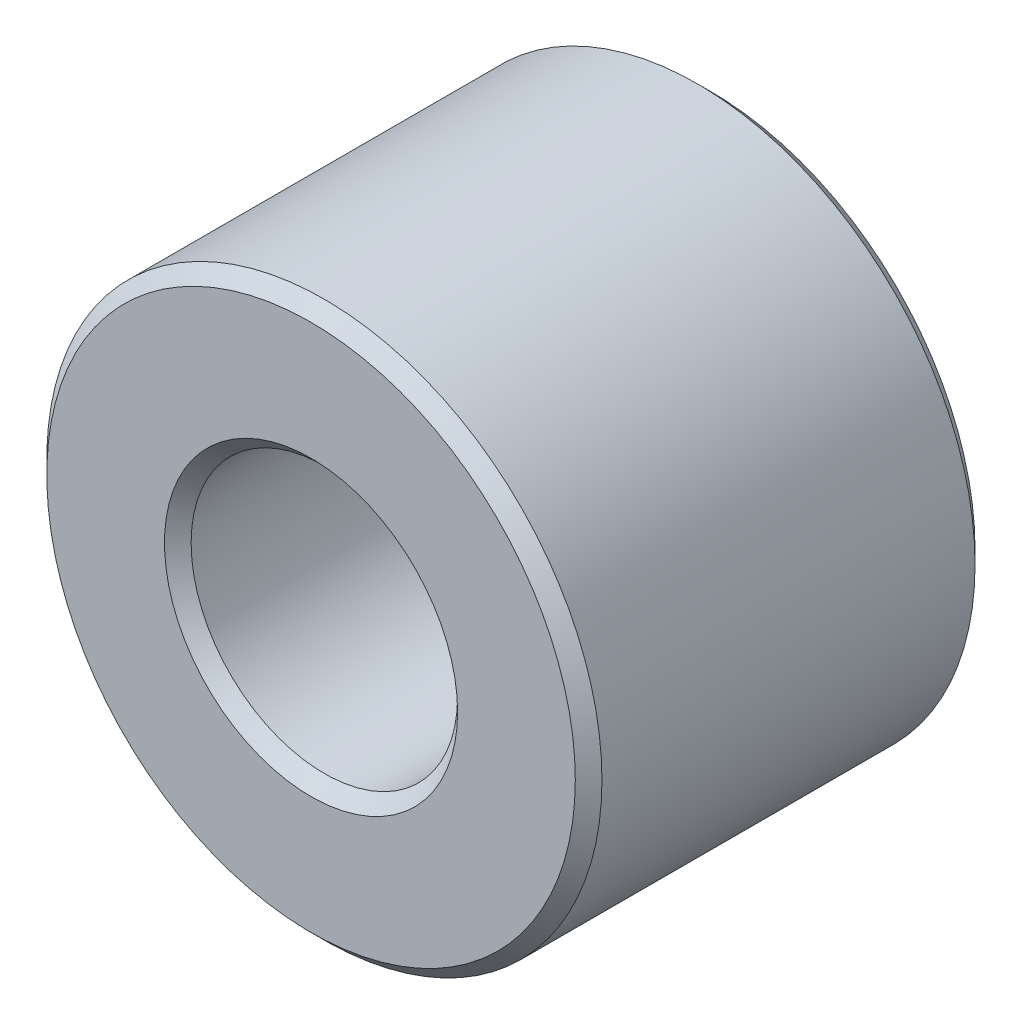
ISO-10303-21;
HEADER;
FILE_DESCRIPTION(('STEP AP214'),'2;1');
FILE_NAME('part.step','',(''),(''),'','','');
FILE_SCHEMA(('AUTOMOTIVE_DESIGN { 1 0 10303 214 1 1 1 1 }'));
ENDSEC;
DATA;
#1=APPLICATION_CONTEXT('core data for automotive mechanical design processes');
#2=APPLICATION_PROTOCOL_DEFINITION('international standard','automotive_design',2000,#1);
#3=PRODUCT_CONTEXT('',#1,'mechanical');
#4=PRODUCT('Part','Part','',(#3));
#5=PRODUCT_RELATED_PRODUCT_CATEGORY('part','',(#4));
#6=PRODUCT_DEFINITION_FORMATION('','',#4);
#7=PRODUCT_DEFINITION_CONTEXT('part definition',#1,'design');
#8=PRODUCT_DEFINITION('design','',#6,#7);
#9=PRODUCT_DEFINITION_SHAPE('','',#8);
#10=(LENGTH_UNIT() NAMED_UNIT(*) SI_UNIT(.MILLI.,.METRE.));
#11=(NAMED_UNIT(*) PLANE_ANGLE_UNIT() SI_UNIT($,.RADIAN.));
#12=(NAMED_UNIT(*) SI_UNIT($,.STERADIAN.) SOLID_ANGLE_UNIT());
#13=UNCERTAINTY_MEASURE_WITH_UNIT(LENGTH_MEASURE(1.E-05),#10,'distance_accuracy_value','');
#14=(GEOMETRIC_REPRESENTATION_CONTEXT(3) GLOBAL_UNCERTAINTY_ASSIGNED_CONTEXT((#13)) GLOBAL_UNIT_ASSIGNED_CONTEXT((#10,
#11,#12)) REPRESENTATION_CONTEXT('',''));
#15=CARTESIAN_POINT('',(0.,0.,0.));
#16=DIRECTION('',(0.,0.,1.));
#17=DIRECTION('',(1.,0.,0.));
#18=AXIS2_PLACEMENT_3D('',#15,#16,#17);
#19=CARTESIAN_POINT('',(0.,0.,18.));
#20=DIRECTION('',(0.,0.,1.));
#21=DIRECTION('',(1.,0.,0.));
#22=AXIS2_PLACEMENT_3D('',#19,#20,#21);
#23=PLANE('',#22);
#24=CARTESIAN_POINT('',(0.,0.,18.));
#25=DIRECTION('',(0.,0.,1.));
#26=DIRECTION('',(1.,0.,0.));
#27=AXIS2_PLACEMENT_3D('',#24,#25,#26);
#28=CIRCLE('',#27,13.2);
#29=CARTESIAN_POINT('',(13.2,0.,18.));
#30=VERTEX_POINT('',#29);
#31=EDGE_CURVE('E10',#30,#30,#28,.F.);
#32=ORIENTED_EDGE('',*,*,#31,.T.);
#33=EDGE_LOOP('',(#32));
#34=FACE_BOUND('',#33,.T.);
#35=CARTESIAN_POINT('',(0.,0.,18.));
#36=DIRECTION('',(0.,0.,1.));
#37=DIRECTION('',(1.,0.,0.));
#38=AXIS2_PLACEMENT_3D('',#35,#36,#37);
#39=CIRCLE('',#38,23.8);
#40=CARTESIAN_POINT('',(23.8,0.,18.));
#41=VERTEX_POINT('',#40);
#42=EDGE_CURVE('E45',#41,#41,#39,.T.);
#43=ORIENTED_EDGE('',*,*,#42,.T.);
#44=EDGE_LOOP('',(#43));
#45=FACE_BOUND('',#44,.T.);
#46=ADVANCED_FACE('F37',(#34,#45),#23,.T.);
#47=CARTESIAN_POINT('',(0.,0.,-18.));
#48=DIRECTION('',(0.,0.,1.));
#49=DIRECTION('',(1.,0.,0.));
#50=AXIS2_PLACEMENT_3D('',#47,#48,#49);
#51=PLANE('',#50);
#52=CARTESIAN_POINT('',(0.,0.,-18.));
#53=DIRECTION('',(0.,0.,1.));
#54=DIRECTION('',(1.,0.,0.));
#55=AXIS2_PLACEMENT_3D('',#52,#53,#54);
#56=CIRCLE('',#55,13.2);
#57=CARTESIAN_POINT('',(13.2,0.,-18.));
#58=VERTEX_POINT('',#57);
#59=EDGE_CURVE('E70',#58,#58,#56,.T.);
#60=ORIENTED_EDGE('',*,*,#59,.T.);
#61=EDGE_LOOP('',(#60));
#62=FACE_BOUND('',#61,.T.);
#63=CARTESIAN_POINT('',(0.,0.,-18.));
#64=DIRECTION('',(0.,0.,1.));
#65=DIRECTION('',(1.,0.,0.));
#66=AXIS2_PLACEMENT_3D('',#63,#64,#65);
#67=CIRCLE('',#66,23.8);
#68=CARTESIAN_POINT('',(23.8,0.,-18.));
#69=VERTEX_POINT('',#68);
#70=EDGE_CURVE('E74',#69,#69,#67,.F.);
#71=ORIENTED_EDGE('',*,*,#70,.T.);
#72=EDGE_LOOP('',(#71));
#73=FACE_BOUND('',#72,.T.);
#74=ADVANCED_FACE('F78',(#62,#73),#51,.F.);
#75=CARTESIAN_POINT('',(0.,0.,18.));
#76=DIRECTION('',(0.,0.,-1.));
#77=DIRECTION('',(-1.,0.,0.));
#78=AXIS2_PLACEMENT_3D('',#75,#76,#77);
#79=CYLINDRICAL_SURFACE('',#78,25.);
#80=CARTESIAN_POINT('',(0.,0.,-16.8));
#81=DIRECTION('',(0.,0.,1.));
#82=DIRECTION('',(1.,0.,0.));
#83=AXIS2_PLACEMENT_3D('',#80,#81,#82);
#84=CIRCLE('',#83,25.);
#85=CARTESIAN_POINT('',(25.,0.,-16.8));
#86=VERTEX_POINT('',#85);
#87=EDGE_CURVE('E52',#86,#86,#84,.T.);
#88=ORIENTED_EDGE('',*,*,#87,.T.);
#89=EDGE_LOOP('',(#88));
#90=FACE_BOUND('',#89,.T.);
#91=CARTESIAN_POINT('',(0.,0.,16.8));
#92=DIRECTION('',(0.,0.,1.));
#93=DIRECTION('',(1.,0.,0.));
#94=AXIS2_PLACEMENT_3D('',#91,#92,#93);
#95=CIRCLE('',#94,25.);
#96=CARTESIAN_POINT('',(25.,0.,16.8));
#97=VERTEX_POINT('',#96);
#98=EDGE_CURVE('E58',#97,#97,#95,.F.);
#99=ORIENTED_EDGE('',*,*,#98,.T.);
#100=EDGE_LOOP('',(#99));
#101=FACE_BOUND('',#100,.T.);
#102=ADVANCED_FACE('F88',(#90,#101),#79,.T.);
#103=CARTESIAN_POINT('',(0.,0.,18.));
#104=DIRECTION('',(0.,0.,-1.));
#105=DIRECTION('',(-1.,0.,0.));
#106=AXIS2_PLACEMENT_3D('',#103,#104,#105);
#107=CYLINDRICAL_SURFACE('',#106,12.);
#108=CARTESIAN_POINT('',(0.,0.,-16.8));
#109=DIRECTION('',(0.,0.,1.));
#110=DIRECTION('',(1.,0.,0.));
#111=AXIS2_PLACEMENT_3D('',#108,#109,#110);
#112=CIRCLE('',#111,12.);
#113=CARTESIAN_POINT('',(12.,0.,-16.8));
#114=VERTEX_POINT('',#113);
#115=EDGE_CURVE('E63',#114,#114,#112,.F.);
#116=ORIENTED_EDGE('',*,*,#115,.T.);
#117=EDGE_LOOP('',(#116));
#118=FACE_BOUND('',#117,.T.);
#119=CARTESIAN_POINT('',(0.,0.,16.8));
#120=DIRECTION('',(0.,0.,1.));
#121=DIRECTION('',(1.,0.,0.));
#122=AXIS2_PLACEMENT_3D('',#119,#120,#121);
#123=CIRCLE('',#122,12.);
#124=CARTESIAN_POINT('',(12.,0.,16.8));
#125=VERTEX_POINT('',#124);
#126=EDGE_CURVE('E67',#125,#125,#123,.T.);
#127=ORIENTED_EDGE('',*,*,#126,.T.);
#128=EDGE_LOOP('',(#127));
#129=FACE_BOUND('',#128,.T.);
#130=ADVANCED_FACE('F91',(#118,#129),#107,.F.);
#131=CARTESIAN_POINT('',(0.,0.,-18.));
#132=DIRECTION('',(0.,0.,-1.));
#133=DIRECTION('',(-1.,0.,0.));
#134=AXIS2_PLACEMENT_3D('',#131,#132,#133);
#135=CONICAL_SURFACE('',#134,13.2,0.785398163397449);
#136=ORIENTED_EDGE('',*,*,#115,.F.);
#137=EDGE_LOOP('',(#136));
#138=FACE_BOUND('',#137,.T.);
#139=ORIENTED_EDGE('',*,*,#59,.F.);
#140=EDGE_LOOP('',(#139));
#141=FACE_BOUND('',#140,.T.);
#142=ADVANCED_FACE('F84',(#138,#141),#135,.F.);
#143=CARTESIAN_POINT('',(0.,0.,-16.8));
#144=DIRECTION('',(0.,0.,1.));
#145=DIRECTION('',(1.,0.,0.));
#146=AXIS2_PLACEMENT_3D('',#143,#144,#145);
#147=CONICAL_SURFACE('',#146,25.,0.78539816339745);
#148=ORIENTED_EDGE('',*,*,#70,.F.);
#149=EDGE_LOOP('',(#148));
#150=FACE_BOUND('',#149,.T.);
#151=ORIENTED_EDGE('',*,*,#87,.F.);
#152=EDGE_LOOP('',(#151));
#153=FACE_BOUND('',#152,.T.);
#154=ADVANCED_FACE('F80',(#150,#153),#147,.T.);
#155=CARTESIAN_POINT('',(0.,0.,16.8));
#156=DIRECTION('',(0.,0.,1.));
#157=DIRECTION('',(1.,0.,0.));
#158=AXIS2_PLACEMENT_3D('',#155,#156,#157);
#159=CONICAL_SURFACE('',#158,12.,0.785398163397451);
#160=ORIENTED_EDGE('',*,*,#31,.F.);
#161=EDGE_LOOP('',(#160));
#162=FACE_BOUND('',#161,.T.);
#163=ORIENTED_EDGE('',*,*,#126,.F.);
#164=EDGE_LOOP('',(#163));
#165=FACE_BOUND('',#164,.T.);
#166=ADVANCED_FACE('F83',(#162,#165),#159,.F.);
#167=CARTESIAN_POINT('',(0.,0.,18.));
#168=DIRECTION('',(0.,0.,-1.));
#169=DIRECTION('',(-1.,0.,0.));
#170=AXIS2_PLACEMENT_3D('',#167,#168,#169);
#171=CONICAL_SURFACE('',#170,23.8,0.78539816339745);
#172=ORIENTED_EDGE('',*,*,#98,.F.);
#173=EDGE_LOOP('',(#172));
#174=FACE_BOUND('',#173,.T.);
#175=ORIENTED_EDGE('',*,*,#42,.F.);
#176=EDGE_LOOP('',(#175));
#177=FACE_BOUND('',#176,.T.);
#178=ADVANCED_FACE('F39',(#174,#177),#171,.T.);
#179=CLOSED_SHELL('',(#46,#74,#102,#130,#142,#154,#166,#178));
#180=MANIFOLD_SOLID_BREP('B2',#179);
#181=ADVANCED_BREP_SHAPE_REPRESENTATION('',(#18,#180),#14);
#182=SHAPE_DEFINITION_REPRESENTATION(#9,#181);
ENDSEC;
END-ISO-10303-21;
